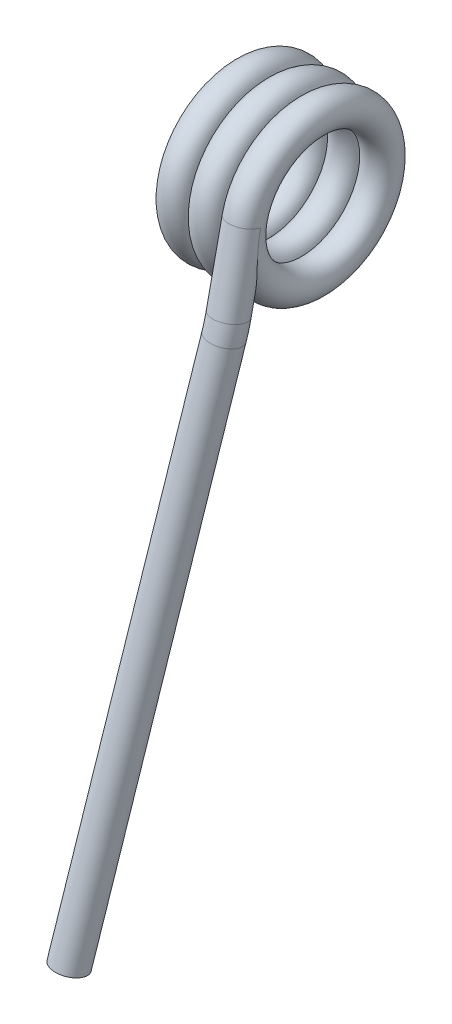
ISO-10303-21;
HEADER;
FILE_DESCRIPTION(('STEP AP214'),'2;1');
FILE_NAME('part.step','',(''),(''),'','','');
FILE_SCHEMA(('AUTOMOTIVE_DESIGN { 1 0 10303 214 1 1 1 1 }'));
ENDSEC;
DATA;
#1=APPLICATION_CONTEXT('core data for automotive mechanical design processes');
#2=APPLICATION_PROTOCOL_DEFINITION('international standard','automotive_design',2000,#1);
#3=PRODUCT_CONTEXT('',#1,'mechanical');
#4=PRODUCT('Part','Part','',(#3));
#5=PRODUCT_RELATED_PRODUCT_CATEGORY('part','',(#4));
#6=PRODUCT_DEFINITION_FORMATION('','',#4);
#7=PRODUCT_DEFINITION_CONTEXT('part definition',#1,'design');
#8=PRODUCT_DEFINITION('design','',#6,#7);
#9=PRODUCT_DEFINITION_SHAPE('','',#8);
#10=(LENGTH_UNIT() NAMED_UNIT(*) SI_UNIT(.MILLI.,.METRE.));
#11=(NAMED_UNIT(*) PLANE_ANGLE_UNIT() SI_UNIT($,.RADIAN.));
#12=(NAMED_UNIT(*) SI_UNIT($,.STERADIAN.) SOLID_ANGLE_UNIT());
#13=UNCERTAINTY_MEASURE_WITH_UNIT(LENGTH_MEASURE(1.E-05),#10,'distance_accuracy_value','');
#14=(GEOMETRIC_REPRESENTATION_CONTEXT(3) GLOBAL_UNCERTAINTY_ASSIGNED_CONTEXT((#13)) GLOBAL_UNIT_ASSIGNED_CONTEXT((#10,
#11,#12)) REPRESENTATION_CONTEXT('',''));
#15=CARTESIAN_POINT('',(0.,0.,0.));
#16=DIRECTION('',(0.,0.,1.));
#17=DIRECTION('',(1.,0.,0.));
#18=AXIS2_PLACEMENT_3D('',#15,#16,#17);
#19=CARTESIAN_POINT('',(2.96194698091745,-3.66232074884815,4.10105723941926));
#20=DIRECTION('',(-0.0871557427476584,-0.97442545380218,0.207120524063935));
#21=DIRECTION('',(0.,-0.207911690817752,-0.978147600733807));
#22=AXIS2_PLACEMENT_3D('',#19,#20,#21);
#23=CYLINDRICAL_SURFACE('',#22,0.75);
#24=CARTESIAN_POINT('',(2.96194698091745,-3.66232074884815,4.10105723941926));
#25=DIRECTION('',(-0.0871557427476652,-0.97442545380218,0.207120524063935));
#26=DIRECTION('',(0.,-0.207911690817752,-0.978147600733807));
#27=AXIS2_PLACEMENT_3D('',#24,#25,#26);
#28=CIRCLE('',#27,0.75);
#29=CARTESIAN_POINT('',(3.70909300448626,-3.72625913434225,4.11464776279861));
#30=VERTEX_POINT('',#29);
#31=EDGE_CURVE('E45',#30,#30,#28,.T.);
#32=ORIENTED_EDGE('',*,*,#31,.T.);
#33=EDGE_LOOP('',(#32));
#34=FACE_BOUND('',#33,.T.);
#35=CARTESIAN_POINT('',(0.821106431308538,-27.597513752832,9.18863956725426));
#36=DIRECTION('',(-0.0871557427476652,-0.97442545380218,0.207120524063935));
#37=DIRECTION('',(0.,-0.207911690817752,-0.978147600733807));
#38=AXIS2_PLACEMENT_3D('',#35,#36,#37);
#39=CIRCLE('',#38,0.75);
#40=CARTESIAN_POINT('',(0.821106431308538,-27.7534475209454,8.45502886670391));
#41=VERTEX_POINT('',#40);
#42=EDGE_CURVE('E11',#41,#41,#39,.T.);
#43=ORIENTED_EDGE('',*,*,#42,.F.);
#44=EDGE_LOOP('',(#43));
#45=FACE_BOUND('',#44,.T.);
#46=ADVANCED_FACE('F36',(#34,#45),#23,.T.);
#47=CARTESIAN_POINT('',(-7.,-2.80980894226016,3.91985026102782));
#48=DIRECTION('',(0.,-0.207911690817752,-0.978147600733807));
#49=DIRECTION('',(0.,0.978147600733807,-0.207911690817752));
#50=AXIS2_PLACEMENT_3D('',#47,#48,#49);
#51=TOROIDAL_SURFACE('',#50,10.,0.75);
#52=CARTESIAN_POINT('',(3.,-2.80980894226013,3.91985026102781));
#53=DIRECTION('',(0.,-0.978147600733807,0.207911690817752));
#54=DIRECTION('',(0.,-0.207911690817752,-0.978147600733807));
#55=AXIS2_PLACEMENT_3D('',#52,#53,#54);
#56=CIRCLE('',#55,0.75);
#57=CARTESIAN_POINT('',(3.75,-2.80980894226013,3.91985026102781));
#58=VERTEX_POINT('',#57);
#59=EDGE_CURVE('E106',#58,#58,#56,.T.);
#60=CARTESIAN_POINT('',(-7.,-2.80980894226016,3.91985026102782));
#61=DIRECTION('',(0.,-0.207911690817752,-0.978147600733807));
#62=DIRECTION('',(0.,0.978147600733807,-0.207911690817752));
#63=AXIS2_PLACEMENT_3D('',#60,#61,#62);
#64=CIRCLE('',#63,10.75);
#65=EDGE_CURVE('',#58,#30,#64,.T.);
#66=ORIENTED_EDGE('',*,*,#59,.T.);
#67=ORIENTED_EDGE('',*,*,#31,.F.);
#68=ORIENTED_EDGE('',*,*,#65,.T.);
#69=ORIENTED_EDGE('',*,*,#65,.F.);
#70=EDGE_LOOP('',(#66,#68,#67,#69));
#71=FACE_BOUND('',#70,.T.);
#72=ADVANCED_FACE('F93',(#71),#51,.T.);
#73=CARTESIAN_POINT('',(3.,-2.80980894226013,3.91985026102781));
#74=DIRECTION('',(0.,0.978147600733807,-0.207911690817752));
#75=DIRECTION('',(0.,0.207911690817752,0.978147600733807));
#76=AXIS2_PLACEMENT_3D('',#73,#74,#75);
#77=CYLINDRICAL_SURFACE('',#76,0.75);
#78=ORIENTED_EDGE('',*,*,#59,.F.);
#79=EDGE_LOOP('',(#78));
#80=FACE_BOUND('',#79,.T.);
#81=CARTESIAN_POINT('',(2.25136172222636,0.685105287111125,3.22316696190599));
#82=CARTESIAN_POINT('',(2.25136369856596,0.653455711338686,3.22989476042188));
#83=CARTESIAN_POINT('',(2.25133353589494,0.621708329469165,3.23616357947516));
#84=CARTESIAN_POINT('',(2.25122256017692,0.558135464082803,3.24775367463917));
#85=CARTESIAN_POINT('',(2.25114189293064,0.526310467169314,3.25307762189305));
#86=CARTESIAN_POINT('',(2.25094359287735,0.462582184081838,3.26277737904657));
#87=CARTESIAN_POINT('',(2.25082603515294,0.430679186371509,3.26715508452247));
#88=CARTESIAN_POINT('',(2.2505812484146,0.366794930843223,3.27496221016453));
#89=CARTESIAN_POINT('',(2.2504540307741,0.334813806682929,3.27839272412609));
#90=CARTESIAN_POINT('',(2.25022701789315,0.27077325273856,3.28430538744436));
#91=CARTESIAN_POINT('',(2.25012721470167,0.2387138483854,3.2867878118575));
#92=CARTESIAN_POINT('',(2.25000310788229,0.174516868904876,3.29080535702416));
#93=CARTESIAN_POINT('',(2.24997884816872,0.142379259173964,3.29233992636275));
#94=CARTESIAN_POINT('',(2.25006377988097,0.0780263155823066,3.29446411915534));
#95=CARTESIAN_POINT('',(2.25017316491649,0.0458109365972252,3.29505236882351));
#96=CARTESIAN_POINT('',(2.25059611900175,-0.0186964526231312,3.29529111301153));
#97=CARTESIAN_POINT('',(2.25091015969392,-0.050988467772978,3.29493943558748));
#98=CARTESIAN_POINT('',(2.25136172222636,-0.0832669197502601,3.29412221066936));
#99=B_SPLINE_CURVE_WITH_KNOTS('',3,(#81,#82,#83,#84,#85,#86,#87,#88,#89,#90,#91,#92,#93,#94,#95,
#96,#97,#98),.UNSPECIFIED.,.F.,.F.,(4,2,2,2,2,2,2,2,4),(0.,0.097067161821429,0.193855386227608,
0.290447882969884,0.386928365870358,0.483380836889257,0.579889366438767,0.676537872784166,
0.773409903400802),.UNSPECIFIED.);
#100=CARTESIAN_POINT('',(2.25136172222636,0.685105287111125,3.22316696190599));
#101=VERTEX_POINT('',#100);
#102=CARTESIAN_POINT('',(2.25136172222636,-0.0832669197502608,3.29412221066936));
#103=VERTEX_POINT('',#102);
#104=EDGE_CURVE('E64',#101,#103,#99,.T.);
#105=ORIENTED_EDGE('',*,*,#104,.T.);
#106=CARTESIAN_POINT('',(3.75,0.675712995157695,3.17897970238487));
#107=CARTESIAN_POINT('',(3.74999993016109,0.649424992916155,3.18456739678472));
#108=CARTESIAN_POINT('',(3.75000005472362,0.623102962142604,3.18999190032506));
#109=CARTESIAN_POINT('',(3.74999980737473,0.5936581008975,3.19586988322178));
#110=CARTESIAN_POINT('',(3.74999977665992,0.59056749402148,3.19648451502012));
#111=CARTESIAN_POINT('',(3.74999959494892,0.57511217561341,3.19954644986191));
#112=CARTESIAN_POINT('',(3.74999935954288,0.562740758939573,3.20196005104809));
#113=CARTESIAN_POINT('',(3.74999881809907,0.546575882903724,3.20506498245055));
#114=CARTESIAN_POINT('',(3.74999867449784,0.542788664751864,3.20578893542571));
#115=CARTESIAN_POINT('',(3.74999784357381,0.523849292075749,3.20939187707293));
#116=CARTESIAN_POINT('',(3.74999681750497,0.508687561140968,3.21222034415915));
#117=CARTESIAN_POINT('',(3.74998927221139,0.432822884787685,3.22609413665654));
#118=CARTESIAN_POINT('',(3.74997550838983,0.371969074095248,3.23633051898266));
#119=CARTESIAN_POINT('',(3.74987714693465,0.251875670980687,3.25478596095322));
#120=CARTESIAN_POINT('',(3.7497947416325,0.192644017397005,3.2630573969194));
#121=CARTESIAN_POINT('',(3.74933066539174,0.0146552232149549,3.28543777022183));
#122=CARTESIAN_POINT('',(3.74873218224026,-0.104416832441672,3.29711660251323));
#123=CARTESIAN_POINT('',(3.74593496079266,-0.343470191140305,3.31410236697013));
#124=CARTESIAN_POINT('',(3.74372985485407,-0.463453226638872,3.31938372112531));
#125=CARTESIAN_POINT('',(3.73610007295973,-0.705633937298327,3.32368994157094));
#126=CARTESIAN_POINT('',(3.73061727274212,-0.827831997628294,3.32259865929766));
#127=CARTESIAN_POINT('',(3.71415487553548,-1.07192004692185,3.31413208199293));
#128=CARTESIAN_POINT('',(3.70316541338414,-1.19380908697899,3.30674549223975));
#129=CARTESIAN_POINT('',(3.68022973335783,-1.37484327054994,3.2913128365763));
#130=CARTESIAN_POINT('',(3.67156756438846,-1.43459784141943,3.28548242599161));
#131=CARTESIAN_POINT('',(3.65156726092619,-1.55350193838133,3.27246360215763));
#132=CARTESIAN_POINT('',(3.64022994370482,-1.61265164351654,3.26527560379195));
#133=CARTESIAN_POINT('',(3.6142497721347,-1.72986185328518,3.24967651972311));
#134=CARTESIAN_POINT('',(3.5996177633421,-1.78792526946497,3.24126947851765));
#135=CARTESIAN_POINT('',(3.56614608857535,-1.90263882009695,3.22338503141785));
#136=CARTESIAN_POINT('',(3.54731090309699,-1.95929038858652,3.2139087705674));
#137=CARTESIAN_POINT('',(3.51767168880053,-2.03557783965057,3.20034584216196));
#138=CARTESIAN_POINT('',(3.50921790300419,-2.05619236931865,3.19659743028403));
#139=CARTESIAN_POINT('',(3.49145182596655,-2.09703378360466,3.18901314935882));
#140=CARTESIAN_POINT('',(3.4821394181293,-2.1172606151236,3.18517726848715));
#141=CARTESIAN_POINT('',(3.45270459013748,-2.17736645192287,3.17355111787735));
#142=CARTESIAN_POINT('',(3.43113209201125,-2.21654445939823,3.1656649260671));
#143=CARTESIAN_POINT('',(3.38282603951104,-2.29243538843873,3.14986478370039));
#144=CARTESIAN_POINT('',(3.35602356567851,-2.32910541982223,3.14195202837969));
#145=CARTESIAN_POINT('',(3.29615713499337,-2.39709252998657,3.12686863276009));
#146=CARTESIAN_POINT('',(3.26313344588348,-2.42844169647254,3.11969365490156));
#147=CARTESIAN_POINT('',(3.20940956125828,-2.46745973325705,3.11059486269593));
#148=CARTESIAN_POINT('',(3.19154371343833,-2.47883525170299,3.10791272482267));
#149=CARTESIAN_POINT('',(3.15426833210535,-2.4988993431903,3.1031493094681));
#150=CARTESIAN_POINT('',(3.13485972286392,-2.50758951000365,3.10106767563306));
#151=CARTESIAN_POINT('',(3.09455675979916,-2.52167234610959,3.0976799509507));
#152=CARTESIAN_POINT('',(3.07364894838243,-2.52702944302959,3.09638223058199));
#153=CARTESIAN_POINT('',(3.03116239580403,-2.53370987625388,3.0947622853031));
#154=CARTESIAN_POINT('',(3.00958439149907,-2.53503749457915,3.09443902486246));
#155=CARTESIAN_POINT('',(2.96907200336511,-2.5335974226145,3.09478883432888));
#156=CARTESIAN_POINT('',(2.95011878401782,-2.53128282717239,3.09535167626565));
#157=CARTESIAN_POINT('',(2.91288048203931,-2.52360584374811,3.09721062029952));
#158=CARTESIAN_POINT('',(2.89459581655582,-2.51824158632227,3.09850717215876));
#159=CARTESIAN_POINT('',(2.85406222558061,-2.50300451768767,3.10216695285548));
#160=CARTESIAN_POINT('',(2.83215163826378,-2.49228637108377,3.10472799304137));
#161=CARTESIAN_POINT('',(2.79038662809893,-2.46756122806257,3.11057057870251));
#162=CARTESIAN_POINT('',(2.77053645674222,-2.45354761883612,3.11385357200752));
#163=CARTESIAN_POINT('',(2.72210380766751,-2.41440316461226,3.12290153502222));
#164=CARTESIAN_POINT('',(2.69503089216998,-2.38750173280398,3.12901116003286));
#165=CARTESIAN_POINT('',(2.64524861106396,-2.33006177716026,3.14172244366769));
#166=CARTESIAN_POINT('',(2.62255044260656,-2.29951423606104,3.14832530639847));
#167=CARTESIAN_POINT('',(2.58145226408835,-2.23716308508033,3.16141294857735));
#168=CARTESIAN_POINT('',(2.56293422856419,-2.20543525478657,3.16789433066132));
#169=CARTESIAN_POINT('',(2.52866661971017,-2.14048378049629,3.1807517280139));
#170=CARTESIAN_POINT('',(2.51291972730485,-2.10725872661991,3.18712763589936));
#171=CARTESIAN_POINT('',(2.46907799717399,-2.00591972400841,3.2059046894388));
#172=CARTESIAN_POINT('',(2.444445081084,-1.93624582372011,3.2179330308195));
#173=CARTESIAN_POINT('',(2.39766323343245,-1.78107809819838,3.24253281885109));
#174=CARTESIAN_POINT('',(2.37691507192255,-1.6951298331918,3.25475973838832));
#175=CARTESIAN_POINT('',(2.34202621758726,-1.52148794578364,3.27642156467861));
#176=CARTESIAN_POINT('',(2.32789457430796,-1.4337921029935,3.2858526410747));
#177=CARTESIAN_POINT('',(2.30443268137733,-1.25744365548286,3.3016265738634));
#178=CARTESIAN_POINT('',(2.2951061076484,-1.16879037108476,3.30796706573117));
#179=CARTESIAN_POINT('',(2.27993139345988,-0.991008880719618,3.31737105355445));
#180=CARTESIAN_POINT('',(2.27408398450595,-0.901880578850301,3.32043386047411));
#181=CARTESIAN_POINT('',(2.26430007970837,-0.712932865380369,3.32331496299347));
#182=CARTESIAN_POINT('',(2.26067011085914,-0.61309173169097,3.32270821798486));
#183=CARTESIAN_POINT('',(2.25536423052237,-0.413624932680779,3.31711718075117));
#184=CARTESIAN_POINT('',(2.25368556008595,-0.313999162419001,3.31213908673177));
#185=CARTESIAN_POINT('',(2.25185560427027,-0.152578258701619,3.30044696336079));
#186=CARTESIAN_POINT('',(2.25136705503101,-0.0906846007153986,3.29509548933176));
#187=CARTESIAN_POINT('',(2.25066228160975,0.032940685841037,3.28265036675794));
#188=CARTESIAN_POINT('',(2.25044610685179,0.0946722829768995,3.27555640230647));
#189=CARTESIAN_POINT('',(2.25012880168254,0.231457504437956,3.2578657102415));
#190=CARTESIAN_POINT('',(2.25006340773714,0.306456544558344,3.2468417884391));
#191=CARTESIAN_POINT('',(2.25001313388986,0.425315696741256,3.22724785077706));
#192=CARTESIAN_POINT('',(2.25000622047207,0.469317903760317,3.21952865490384));
#193=CARTESIAN_POINT('',(2.2500009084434,0.541108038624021,3.20617116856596));
#194=CARTESIAN_POINT('',(2.25000032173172,0.568946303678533,3.20080300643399));
#195=CARTESIAN_POINT('',(2.25000001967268,0.62310313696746,3.18999187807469));
#196=CARTESIAN_POINT('',(2.25000026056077,0.649425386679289,3.1845673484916));
#197=CARTESIAN_POINT('',(2.25,0.675712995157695,3.17897970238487));
#198=B_SPLINE_CURVE_WITH_KNOTS('',3,(#106,#107,#108,#109,#110,#111,#112,#113,#114,#115,#116,
#117,#118,#119,#120,#121,#122,#123,#124,#125,#126,#127,#128,#129,#130,#131,#132,#133,#134,#135,
#136,#137,#138,#139,#140,#141,#142,#143,#144,#145,#146,#147,#148,#149,#150,#151,#152,#153,#154,
#155,#156,#157,#158,#159,#160,#161,#162,#163,#164,#165,#166,#167,#168,#169,#170,#171,#172,#173,
#174,#175,#176,#177,#178,#179,#180,#181,#182,#183,#184,#185,#186,#187,#188,#189,#190,#191,#192,
#193,#194,#195,#196,#197),.UNSPECIFIED.,.F.,.F.,(4,2,2,2,2,2,2,2,2,2,2,2,2,2,2,2,2,2,2,2,2,2,2,
2,2,2,2,2,2,2,2,2,2,2,2,2,2,2,2,2,2,2,2,2,2,4),(0.,0.0806241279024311,0.0900775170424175,
0.127891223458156,0.139458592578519,0.185728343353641,0.370824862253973,0.550226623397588,
0.908965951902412,1.26913488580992,1.63588855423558,2.00330162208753,2.18522291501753,
2.36708870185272,2.54836435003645,2.72944767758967,2.7972113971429,2.86498433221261,
3.00093942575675,3.13882455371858,3.27584609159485,3.3397089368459,3.40353380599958,
3.46802866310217,3.53245495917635,3.58947746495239,3.6465349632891,3.71970233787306,
3.79301780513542,3.90832098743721,4.02391547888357,4.13565791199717,4.24750786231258,
4.47157467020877,4.73895750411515,5.00670498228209,5.2746569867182,5.54266530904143,
5.84226765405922,6.1414458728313,6.32780250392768,6.51419294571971,6.74155721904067,
6.87557107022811,6.96062205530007,7.0412461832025),.UNSPECIFIED.);
#199=CARTESIAN_POINT('',(3.75,0.675712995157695,3.17897970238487));
#200=VERTEX_POINT('',#199);
#201=EDGE_CURVE('E59',#103,#200,#198,.F.);
#202=ORIENTED_EDGE('',*,*,#201,.T.);
#203=CARTESIAN_POINT('',(3.,0.675712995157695,3.17897970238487));
#204=DIRECTION('',(0.,-0.978147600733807,0.207911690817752));
#205=DIRECTION('',(0.,-0.207911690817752,-0.978147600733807));
#206=AXIS2_PLACEMENT_3D('',#203,#204,#205);
#207=CIRCLE('',#206,0.75);
#208=EDGE_CURVE('E39',#200,#101,#207,.T.);
#209=ORIENTED_EDGE('',*,*,#208,.T.);
#210=EDGE_LOOP('',(#105,#202,#209));
#211=FACE_BOUND('',#210,.T.);
#212=ADVANCED_FACE('F73',(#80,#211),#77,.T.);
#213=CARTESIAN_POINT('',(0.821106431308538,-27.597513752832,9.18863956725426));
#214=DIRECTION('',(-0.0871557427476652,-0.97442545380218,0.207120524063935));
#215=DIRECTION('',(0.,-0.207911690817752,-0.978147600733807));
#216=AXIS2_PLACEMENT_3D('',#213,#214,#215);
#217=PLANE('',#216);
#218=ORIENTED_EDGE('',*,*,#42,.T.);
#219=EDGE_LOOP('',(#218));
#220=FACE_BOUND('',#219,.T.);
#221=ADVANCED_FACE('F92',(#220),#217,.T.);
#222=CARTESIAN_POINT('',(3.,0.,0.));
#223=DIRECTION('',(1.,0.,0.));
#224=DIRECTION('',(0.,0.,-1.));
#225=AXIS2_PLACEMENT_3D('',#222,#223,#224);
#226=TOROIDAL_SURFACE('',#225,3.25,0.750000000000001);
#227=ORIENTED_EDGE('',*,*,#208,.F.);
#228=ORIENTED_EDGE('',*,*,#201,.F.);
#229=CARTESIAN_POINT('',(2.25136172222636,0.,0.));
#230=DIRECTION('',(1.,0.,0.));
#231=DIRECTION('',(0.,0.,-1.));
#232=AXIS2_PLACEMENT_3D('',#229,#230,#231);
#233=CIRCLE('',#232,3.29517442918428);
#234=EDGE_CURVE('E53',#103,#101,#233,.T.);
#235=ORIENTED_EDGE('',*,*,#234,.T.);
#236=EDGE_LOOP('',(#227,#228,#235));
#237=FACE_BOUND('',#236,.T.);
#238=CARTESIAN_POINT('',(2.25136172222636,0.,0.));
#239=DIRECTION('',(1.,0.,0.));
#240=DIRECTION('',(0.,0.,-1.));
#241=AXIS2_PLACEMENT_3D('',#238,#239,#240);
#242=CIRCLE('',#241,3.20482557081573);
#243=CARTESIAN_POINT('',(2.25136172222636,0.,-3.20482557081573));
#244=VERTEX_POINT('',#243);
#245=EDGE_CURVE('E69',#244,#244,#242,.T.);
#246=ORIENTED_EDGE('',*,*,#245,.F.);
#247=EDGE_LOOP('',(#246));
#248=FACE_BOUND('',#247,.T.);
#249=ADVANCED_FACE('F60',(#237,#248),#226,.T.);
#250=CARTESIAN_POINT('',(0.,0.,0.));
#251=DIRECTION('',(1.,0.,0.));
#252=DIRECTION('',(0.,0.,-1.));
#253=AXIS2_PLACEMENT_3D('',#250,#251,#252);
#254=CYLINDRICAL_SURFACE('',#253,3.29517442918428);
#255=CARTESIAN_POINT('',(2.24863827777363,0.,0.));
#256=DIRECTION('',(1.,0.,0.));
#257=DIRECTION('',(0.,0.,-1.));
#258=AXIS2_PLACEMENT_3D('',#255,#256,#257);
#259=CIRCLE('',#258,3.29517442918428);
#260=CARTESIAN_POINT('',(2.24863827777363,0.,-3.29517442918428));
#261=VERTEX_POINT('',#260);
#262=EDGE_CURVE('E70',#261,#261,#259,.T.);
#263=ORIENTED_EDGE('',*,*,#262,.T.);
#264=EDGE_LOOP('',(#263));
#265=FACE_BOUND('',#264,.T.);
#266=ORIENTED_EDGE('',*,*,#104,.F.);
#267=ORIENTED_EDGE('',*,*,#234,.F.);
#268=EDGE_LOOP('',(#266,#267));
#269=FACE_BOUND('',#268,.T.);
#270=ADVANCED_FACE('F67',(#265,#269),#254,.T.);
#271=CARTESIAN_POINT('',(1.5,0.,0.));
#272=DIRECTION('',(1.,0.,0.));
#273=DIRECTION('',(0.,0.,-1.));
#274=AXIS2_PLACEMENT_3D('',#271,#272,#273);
#275=TOROIDAL_SURFACE('',#274,3.25,0.75);
#276=CARTESIAN_POINT('',(2.24863827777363,0.,0.));
#277=DIRECTION('',(1.,0.,0.));
#278=DIRECTION('',(0.,0.,-1.));
#279=AXIS2_PLACEMENT_3D('',#276,#277,#278);
#280=CIRCLE('',#279,3.20482557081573);
#281=CARTESIAN_POINT('',(2.24863827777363,0.,-3.20482557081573));
#282=VERTEX_POINT('',#281);
#283=EDGE_CURVE('E74',#282,#282,#280,.T.);
#284=ORIENTED_EDGE('',*,*,#283,.T.);
#285=EDGE_LOOP('',(#284));
#286=FACE_BOUND('',#285,.T.);
#287=CARTESIAN_POINT('',(0.751361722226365,0.,0.));
#288=DIRECTION('',(1.,0.,0.));
#289=DIRECTION('',(0.,0.,-1.));
#290=AXIS2_PLACEMENT_3D('',#287,#288,#289);
#291=CIRCLE('',#290,3.20482557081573);
#292=CARTESIAN_POINT('',(0.751361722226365,0.,-3.20482557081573));
#293=VERTEX_POINT('',#292);
#294=EDGE_CURVE('E162',#293,#293,#291,.T.);
#295=ORIENTED_EDGE('',*,*,#294,.F.);
#296=EDGE_LOOP('',(#295));
#297=FACE_BOUND('',#296,.T.);
#298=ADVANCED_FACE('F126',(#286,#297),#275,.T.);
#299=CARTESIAN_POINT('',(0.,0.,0.));
#300=DIRECTION('',(1.,0.,0.));
#301=DIRECTION('',(0.,0.,-1.));
#302=AXIS2_PLACEMENT_3D('',#299,#300,#301);
#303=CYLINDRICAL_SURFACE('',#302,3.20482557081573);
#304=ORIENTED_EDGE('',*,*,#245,.T.);
#305=EDGE_LOOP('',(#304));
#306=FACE_BOUND('',#305,.T.);
#307=ORIENTED_EDGE('',*,*,#283,.F.);
#308=EDGE_LOOP('',(#307));
#309=FACE_BOUND('',#308,.T.);
#310=ADVANCED_FACE('F129',(#306,#309),#303,.F.);
#311=CARTESIAN_POINT('',(1.5,0.,0.));
#312=DIRECTION('',(1.,0.,0.));
#313=DIRECTION('',(0.,0.,-1.));
#314=AXIS2_PLACEMENT_3D('',#311,#312,#313);
#315=TOROIDAL_SURFACE('',#314,3.25,0.75);
#316=CARTESIAN_POINT('',(0.751361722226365,0.,0.));
#317=DIRECTION('',(1.,0.,0.));
#318=DIRECTION('',(0.,0.,-1.));
#319=AXIS2_PLACEMENT_3D('',#316,#317,#318);
#320=CIRCLE('',#319,3.29517442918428);
#321=CARTESIAN_POINT('',(0.751361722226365,0.,-3.29517442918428));
#322=VERTEX_POINT('',#321);
#323=EDGE_CURVE('E169',#322,#322,#320,.T.);
#324=ORIENTED_EDGE('',*,*,#323,.T.);
#325=EDGE_LOOP('',(#324));
#326=FACE_BOUND('',#325,.T.);
#327=ORIENTED_EDGE('',*,*,#262,.F.);
#328=EDGE_LOOP('',(#327));
#329=FACE_BOUND('',#328,.T.);
#330=ADVANCED_FACE('F131',(#326,#329),#315,.T.);
#331=CARTESIAN_POINT('',(0.,0.,0.));
#332=DIRECTION('',(1.,0.,0.));
#333=DIRECTION('',(0.,0.,-1.));
#334=AXIS2_PLACEMENT_3D('',#331,#332,#333);
#335=CYLINDRICAL_SURFACE('',#334,3.29517442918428);
#336=CARTESIAN_POINT('',(0.748638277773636,0.,0.));
#337=DIRECTION('',(1.,0.,0.));
#338=DIRECTION('',(0.,0.,-1.));
#339=AXIS2_PLACEMENT_3D('',#336,#337,#338);
#340=CIRCLE('',#339,3.29517442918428);
#341=CARTESIAN_POINT('',(0.748638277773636,0.,-3.29517442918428));
#342=VERTEX_POINT('',#341);
#343=EDGE_CURVE('E166',#342,#342,#340,.T.);
#344=ORIENTED_EDGE('',*,*,#343,.T.);
#345=EDGE_LOOP('',(#344));
#346=FACE_BOUND('',#345,.T.);
#347=ORIENTED_EDGE('',*,*,#323,.F.);
#348=EDGE_LOOP('',(#347));
#349=FACE_BOUND('',#348,.T.);
#350=ADVANCED_FACE('F138',(#346,#349),#335,.T.);
#351=CARTESIAN_POINT('',(0.,0.,0.));
#352=DIRECTION('',(1.,0.,0.));
#353=DIRECTION('',(0.,0.,-1.));
#354=AXIS2_PLACEMENT_3D('',#351,#352,#353);
#355=TOROIDAL_SURFACE('',#354,3.25,0.75);
#356=CARTESIAN_POINT('',(0.748638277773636,0.,0.));
#357=DIRECTION('',(1.,0.,0.));
#358=DIRECTION('',(0.,0.,-1.));
#359=AXIS2_PLACEMENT_3D('',#356,#357,#358);
#360=CIRCLE('',#359,3.20482557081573);
#361=CARTESIAN_POINT('',(0.748638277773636,0.,-3.20482557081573));
#362=VERTEX_POINT('',#361);
#363=EDGE_CURVE('E165',#362,#362,#360,.T.);
#364=ORIENTED_EDGE('',*,*,#363,.T.);
#365=EDGE_LOOP('',(#364));
#366=FACE_BOUND('',#365,.T.);
#367=ORIENTED_EDGE('',*,*,#343,.F.);
#368=EDGE_LOOP('',(#367));
#369=FACE_BOUND('',#368,.T.);
#370=ADVANCED_FACE('F149',(#366,#369),#355,.T.);
#371=CARTESIAN_POINT('',(0.,0.,0.));
#372=DIRECTION('',(1.,0.,0.));
#373=DIRECTION('',(0.,0.,-1.));
#374=AXIS2_PLACEMENT_3D('',#371,#372,#373);
#375=CYLINDRICAL_SURFACE('',#374,3.20482557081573);
#376=ORIENTED_EDGE('',*,*,#294,.T.);
#377=EDGE_LOOP('',(#376));
#378=FACE_BOUND('',#377,.T.);
#379=ORIENTED_EDGE('',*,*,#363,.F.);
#380=EDGE_LOOP('',(#379));
#381=FACE_BOUND('',#380,.T.);
#382=ADVANCED_FACE('F153',(#378,#381),#375,.F.);
#383=CLOSED_SHELL('',(#46,#72,#212,#221,#249,#270,#298,#310,#330,#350,#370,#382));
#384=MANIFOLD_SOLID_BREP('B2',#383);
#385=ADVANCED_BREP_SHAPE_REPRESENTATION('',(#18,#384),#14);
#386=SHAPE_DEFINITION_REPRESENTATION(#9,#385);
ENDSEC;
END-ISO-10303-21;
